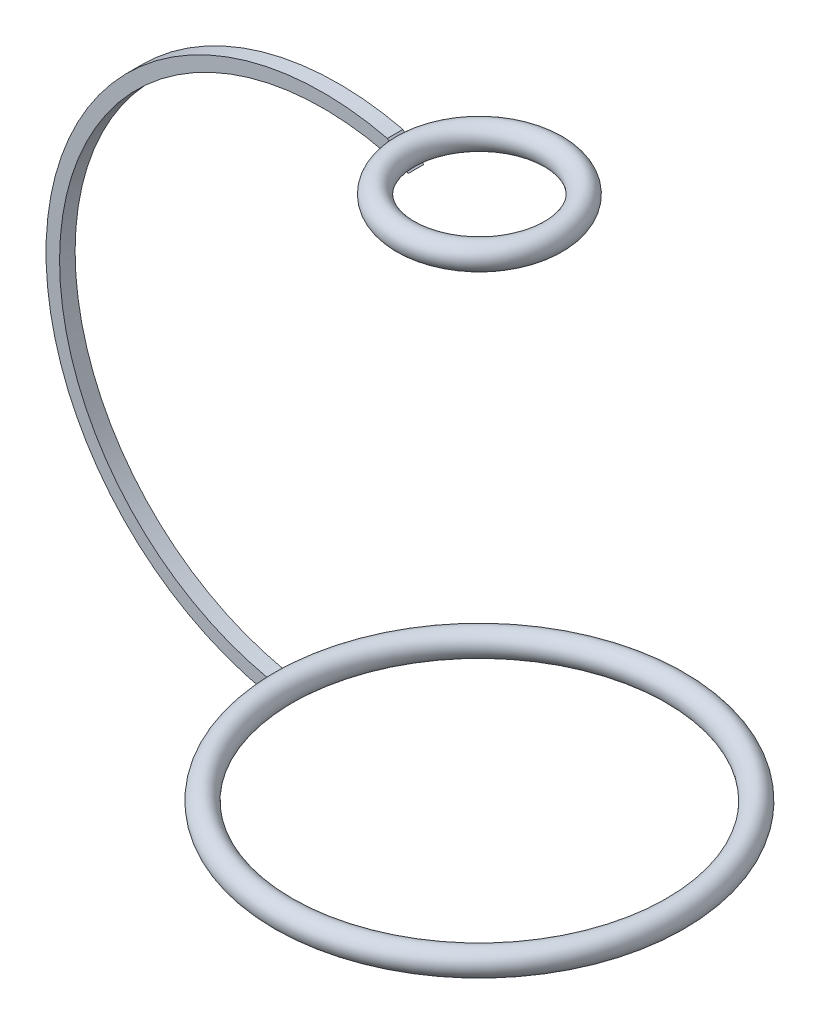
ISO-10303-21;
HEADER;
FILE_DESCRIPTION(('STEP AP214'),'2;1');
FILE_NAME('part.step','',(''),(''),'','','');
FILE_SCHEMA(('AUTOMOTIVE_DESIGN { 1 0 10303 214 1 1 1 1 }'));
ENDSEC;
DATA;
#1=APPLICATION_CONTEXT('core data for automotive mechanical design processes');
#2=APPLICATION_PROTOCOL_DEFINITION('international standard','automotive_design',2000,#1);
#3=PRODUCT_CONTEXT('',#1,'mechanical');
#4=PRODUCT('Part','Part','',(#3));
#5=PRODUCT_RELATED_PRODUCT_CATEGORY('part','',(#4));
#6=PRODUCT_DEFINITION_FORMATION('','',#4);
#7=PRODUCT_DEFINITION_CONTEXT('part definition',#1,'design');
#8=PRODUCT_DEFINITION('design','',#6,#7);
#9=PRODUCT_DEFINITION_SHAPE('','',#8);
#10=(LENGTH_UNIT() NAMED_UNIT(*) SI_UNIT(.MILLI.,.METRE.));
#11=(NAMED_UNIT(*) PLANE_ANGLE_UNIT() SI_UNIT($,.RADIAN.));
#12=(NAMED_UNIT(*) SI_UNIT($,.STERADIAN.) SOLID_ANGLE_UNIT());
#13=UNCERTAINTY_MEASURE_WITH_UNIT(LENGTH_MEASURE(1.E-05),#10,'distance_accuracy_value','');
#14=(GEOMETRIC_REPRESENTATION_CONTEXT(3) GLOBAL_UNCERTAINTY_ASSIGNED_CONTEXT((#13)) GLOBAL_UNIT_ASSIGNED_CONTEXT((#10,
#11,#12)) REPRESENTATION_CONTEXT('',''));
#15=CARTESIAN_POINT('',(0.,0.,0.));
#16=DIRECTION('',(0.,0.,1.));
#17=DIRECTION('',(1.,0.,0.));
#18=AXIS2_PLACEMENT_3D('',#15,#16,#17);
#19=CARTESIAN_POINT('',(-11.8631552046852,-32.6884544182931,0.500000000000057));
#20=DIRECTION('',(-0.389431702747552,0.921055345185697,0.));
#21=DIRECTION('',(-0.921055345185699,-0.389431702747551,0.));
#22=AXIS2_PLACEMENT_3D('',#19,#20,#21);
#23=PLANE('',#22);
#24=DIRECTION('',(0.921055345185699,0.389431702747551,0.));
#25=VECTOR('',#24,1.);
#26=CARTESIAN_POINT('',(-11.8631552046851,-32.6884544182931,-0.500000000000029));
#27=LINE('',#26,#25);
#28=CARTESIAN_POINT('',(-13.3368442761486,-33.311545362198,-0.500000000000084));
#29=VERTEX_POINT('',#28);
#30=CARTESIAN_POINT('',(-13.3288835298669,-33.3081794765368,-0.500000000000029));
#31=VERTEX_POINT('',#30);
#32=EDGE_CURVE('E123',#29,#31,#27,.T.);
#33=ORIENTED_EDGE('',*,*,#32,.T.);
#34=CARTESIAN_POINT('',(-13.3288771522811,-33.3081767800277,-0.500199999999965));
#35=CARTESIAN_POINT('',(-13.3341885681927,-33.3104225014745,-0.333466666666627));
#36=CARTESIAN_POINT('',(-13.3368442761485,-33.311545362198,-0.166733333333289));
#37=CARTESIAN_POINT('',(-13.3368442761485,-33.311545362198,0.166733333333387));
#38=CARTESIAN_POINT('',(-13.3341885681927,-33.3104225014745,0.333466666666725));
#39=CARTESIAN_POINT('',(-13.3288771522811,-33.3081767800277,0.500200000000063));
#40=B_SPLINE_CURVE_WITH_KNOTS('',3,(#34,#35,#36,#37,#38,#39),.UNSPECIFIED.,.F.,.F.,(4,2,4),(0.,
0.50027478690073,1.00054957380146),.UNSPECIFIED.);
#41=CARTESIAN_POINT('',(-13.3368442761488,-33.311545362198,0.));
#42=VERTEX_POINT('',#41);
#43=EDGE_CURVE('E11',#31,#42,#40,.T.);
#44=ORIENTED_EDGE('',*,*,#43,.T.);
#45=DIRECTION('',(0.,0.,-1.));
#46=VECTOR('',#45,1.);
#47=CARTESIAN_POINT('',(-13.3368442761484,-33.311545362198,0.499999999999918));
#48=LINE('',#47,#46);
#49=EDGE_CURVE('E120',#42,#29,#48,.T.);
#50=ORIENTED_EDGE('',*,*,#49,.T.);
#51=EDGE_LOOP('',(#33,#44,#50));
#52=FACE_BOUND('',#51,.T.);
#53=ADVANCED_FACE('F30',(#52),#23,.F.);
#54=CARTESIAN_POINT('',(-9.55723825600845,-15.891797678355,0.500000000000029));
#55=DIRECTION('',(0.,0.,-1.));
#56=DIRECTION('',(-1.,0.,0.));
#57=AXIS2_PLACEMENT_3D('',#54,#55,#56);
#58=CYLINDRICAL_SURFACE('',#57,16.9542011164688);
#59=CARTESIAN_POINT('',(-9.55723825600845,-15.891797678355,0.500000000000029));
#60=DIRECTION('',(0.,0.,-1.));
#61=DIRECTION('',(1.,0.,0.));
#62=AXIS2_PLACEMENT_3D('',#59,#60,#61);
#63=CIRCLE('',#62,16.9542011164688);
#64=CARTESIAN_POINT('',(-13.1763601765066,-32.4552179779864,0.499999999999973));
#65=VERTEX_POINT('',#64);
#66=CARTESIAN_POINT('',(-5.49292410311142,0.568040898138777,0.499999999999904));
#67=VERTEX_POINT('',#66);
#68=EDGE_CURVE('E231',#65,#67,#63,.T.);
#69=ORIENTED_EDGE('',*,*,#68,.F.);
#70=CARTESIAN_POINT('',(-13.1763538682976,-32.4552193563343,0.500199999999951));
#71=CARTESIAN_POINT('',(-13.1816089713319,-32.4540698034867,0.333466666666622));
#72=CARTESIAN_POINT('',(-13.184236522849,-32.4534950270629,0.166733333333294));
#73=CARTESIAN_POINT('',(-13.184236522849,-32.4534950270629,-0.166733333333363));
#74=CARTESIAN_POINT('',(-13.1816089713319,-32.4540698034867,-0.333466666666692));
#75=CARTESIAN_POINT('',(-13.1763538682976,-32.4552193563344,-0.500200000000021));
#76=B_SPLINE_CURVE_WITH_KNOTS('',3,(#70,#71,#72,#73,#74,#75),.UNSPECIFIED.,.F.,.F.,(4,2,4),(0.,
0.500265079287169,1.00053015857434),.UNSPECIFIED.);
#77=CARTESIAN_POINT('',(-13.1763601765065,-32.4552179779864,-0.500000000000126));
#78=VERTEX_POINT('',#77);
#79=EDGE_CURVE('E175',#65,#78,#76,.T.);
#80=ORIENTED_EDGE('',*,*,#79,.T.);
#81=CARTESIAN_POINT('',(-9.55723825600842,-15.891797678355,-0.500000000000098));
#82=DIRECTION('',(0.,0.,-1.));
#83=DIRECTION('',(1.,0.,0.));
#84=AXIS2_PLACEMENT_3D('',#81,#82,#83);
#85=CIRCLE('',#84,16.9542011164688);
#86=CARTESIAN_POINT('',(-5.49292410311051,0.568040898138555,-0.500000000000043));
#87=VERTEX_POINT('',#86);
#88=EDGE_CURVE('E182',#78,#87,#85,.T.);
#89=ORIENTED_EDGE('',*,*,#88,.T.);
#90=CARTESIAN_POINT('',(-5.49290441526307,0.568036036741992,-0.500200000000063));
#91=CARTESIAN_POINT('',(-5.50925855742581,0.57206134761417,-0.333466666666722));
#92=CARTESIAN_POINT('',(-5.51743562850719,0.574074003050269,-0.16673333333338));
#93=CARTESIAN_POINT('',(-5.51743562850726,0.574074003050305,0.166733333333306));
#94=CARTESIAN_POINT('',(-5.50925855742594,0.572061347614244,0.333466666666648));
#95=CARTESIAN_POINT('',(-5.49290441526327,0.568036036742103,0.500199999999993));
#96=B_SPLINE_CURVE_WITH_KNOTS('',3,(#90,#91,#92,#93,#94,#95),.UNSPECIFIED.,.F.,.F.,(4,2,4),(0.,
0.500837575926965,1.00167515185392),.UNSPECIFIED.);
#97=EDGE_CURVE('E194',#87,#67,#96,.T.);
#98=ORIENTED_EDGE('',*,*,#97,.T.);
#99=EDGE_LOOP('',(#69,#80,#89,#98));
#100=FACE_BOUND('',#99,.T.);
#101=ADVANCED_FACE('F188',(#100),#58,.F.);
#102=CARTESIAN_POINT('',(-5.41786459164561,1.44598236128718,0.49999999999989));
#103=DIRECTION('',(-0.695233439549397,-0.718784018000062,0.));
#104=DIRECTION('',(0.718784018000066,-0.695233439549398,0.));
#105=AXIS2_PLACEMENT_3D('',#102,#103,#104);
#106=PLANE('',#105);
#107=DIRECTION('',(-0.718784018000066,0.695233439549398,0.));
#108=VECTOR('',#107,1.);
#109=CARTESIAN_POINT('',(-5.41786459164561,1.44598236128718,0.49999999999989));
#110=LINE('',#109,#108);
#111=CARTESIAN_POINT('',(-5.31277848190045,1.34433934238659,0.499999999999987));
#112=VERTEX_POINT('',#111);
#113=CARTESIAN_POINT('',(-5.41786459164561,1.44598236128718,0.49999999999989));
#114=VERTEX_POINT('',#113);
#115=EDGE_CURVE('E229',#112,#114,#110,.T.);
#116=ORIENTED_EDGE('',*,*,#115,.F.);
#117=CARTESIAN_POINT('',(-5.31276858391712,1.3443297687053,0.500200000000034));
#118=CARTESIAN_POINT('',(-5.31688269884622,1.3483090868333,0.416915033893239));
#119=CARTESIAN_POINT('',(-5.31994852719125,1.35127446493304,0.333532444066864));
#120=CARTESIAN_POINT('',(-5.32401959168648,1.3552121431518,0.166766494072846));
#121=CARTESIAN_POINT('',(-5.32502721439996,1.35618675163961,0.0833832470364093));
#122=CARTESIAN_POINT('',(-5.32502721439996,1.35618675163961,-0.083383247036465));
#123=CARTESIAN_POINT('',(-5.32401959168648,1.3552121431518,-0.166766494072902));
#124=CARTESIAN_POINT('',(-5.31994852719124,1.35127446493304,-0.33353244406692));
#125=CARTESIAN_POINT('',(-5.3168826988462,1.3483090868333,-0.416915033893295));
#126=CARTESIAN_POINT('',(-5.31276858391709,1.3443297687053,-0.50020000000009));
#127=B_SPLINE_CURVE_WITH_KNOTS('',3,(#117,#118,#119,#120,#121,#122,#123,#124,#125,#126),
.UNSPECIFIED.,.F.,.F.,(4,2,2,2,4),(0.,0.250427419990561,0.500564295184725,0.750701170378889,
1.00112859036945),.UNSPECIFIED.);
#128=CARTESIAN_POINT('',(-5.31277848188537,1.34433934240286,-0.500000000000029));
#129=VERTEX_POINT('',#128);
#130=EDGE_CURVE('E149',#112,#129,#127,.T.);
#131=ORIENTED_EDGE('',*,*,#130,.T.);
#132=DIRECTION('',(-0.718784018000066,0.695233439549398,0.));
#133=VECTOR('',#132,1.);
#134=CARTESIAN_POINT('',(-5.41786459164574,1.44598236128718,-0.500000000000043));
#135=LINE('',#134,#133);
#136=CARTESIAN_POINT('',(-5.41786459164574,1.44598236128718,-0.500000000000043));
#137=VERTEX_POINT('',#136);
#138=EDGE_CURVE('E235',#129,#137,#135,.T.);
#139=ORIENTED_EDGE('',*,*,#138,.T.);
#140=DIRECTION('',(0.,0.,-1.));
#141=VECTOR('',#140,1.);
#142=CARTESIAN_POINT('',(-5.41786459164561,1.44598236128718,0.49999999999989));
#143=LINE('',#142,#141);
#144=EDGE_CURVE('E135',#114,#137,#143,.T.);
#145=ORIENTED_EDGE('',*,*,#144,.F.);
#146=EDGE_LOOP('',(#116,#131,#139,#145));
#147=FACE_BOUND('',#146,.T.);
#148=ADVANCED_FACE('F189',(#147),#106,.F.);
#149=CARTESIAN_POINT('',(-9.55723825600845,-15.891797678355,0.500000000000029));
#150=DIRECTION('',(0.,0.,1.));
#151=DIRECTION('',(1.,0.,0.));
#152=AXIS2_PLACEMENT_3D('',#149,#150,#151);
#153=PLANE('',#152);
#154=CARTESIAN_POINT('',(-13.3892009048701,-33.0484168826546,0.500000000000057));
#155=CARTESIAN_POINT('',(-13.3864786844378,-33.0932498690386,0.500000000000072));
#156=CARTESIAN_POINT('',(-13.3799674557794,-33.1378856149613,0.500000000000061));
#157=CARTESIAN_POINT('',(-13.3595361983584,-33.2254669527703,0.499999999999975));
#158=CARTESIAN_POINT('',(-13.3456072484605,-33.2684104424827,0.4999999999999));
#159=CARTESIAN_POINT('',(-13.3107420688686,-33.3513314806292,0.499999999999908));
#160=CARTESIAN_POINT('',(-13.2898093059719,-33.3913104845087,0.49999999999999));
#161=CARTESIAN_POINT('',(-13.2415366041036,-33.4671770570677,0.500000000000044));
#162=CARTESIAN_POINT('',(-13.2141982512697,-33.5030656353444,0.500000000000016));
#163=CARTESIAN_POINT('',(-13.1538751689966,-33.5697634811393,0.500000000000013));
#164=CARTESIAN_POINT('',(-13.1208879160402,-33.6005704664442,0.500000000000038));
#165=CARTESIAN_POINT('',(-13.0502113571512,-33.6562148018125,0.499999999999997));
#166=CARTESIAN_POINT('',(-13.0125218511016,-33.6810518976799,0.49999999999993));
#167=CARTESIAN_POINT('',(-12.9334847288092,-33.7240678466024,0.499999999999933));
#168=CARTESIAN_POINT('',(-12.8921346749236,-33.7422422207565,0.500000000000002));
#169=CARTESIAN_POINT('',(-12.8069716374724,-33.7713960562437,0.500000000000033));
#170=CARTESIAN_POINT('',(-12.763158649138,-33.7823755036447,0.499999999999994));
#171=CARTESIAN_POINT('',(-12.6742824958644,-33.796834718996,0.499999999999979));
#172=CARTESIAN_POINT('',(-12.6292185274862,-33.8003095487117,0.500000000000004));
#173=CARTESIAN_POINT('',(-12.5391466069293,-33.7996471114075,0.500000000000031));
#174=CARTESIAN_POINT('',(-12.4941386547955,-33.795509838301,0.500000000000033));
#175=CARTESIAN_POINT('',(-12.405440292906,-33.7797376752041,0.500000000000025));
#176=CARTESIAN_POINT('',(-12.3617503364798,-33.7681002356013,0.500000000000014));
#177=CARTESIAN_POINT('',(-12.2769446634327,-33.7376544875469,0.500000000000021));
#178=CARTESIAN_POINT('',(-12.2358289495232,-33.7188461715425,0.500000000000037));
#179=CARTESIAN_POINT('',(-12.1573468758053,-33.6745944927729,0.500000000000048));
#180=CARTESIAN_POINT('',(-12.1199799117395,-33.6491522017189,0.500000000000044));
#181=CARTESIAN_POINT('',(-12.0500512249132,-33.5923516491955,0.499999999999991));
#182=CARTESIAN_POINT('',(-12.0174894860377,-33.560993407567,0.499999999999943));
#183=CARTESIAN_POINT('',(-11.958118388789,-33.493271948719,0.499999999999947));
#184=CARTESIAN_POINT('',(-11.9313053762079,-33.4569119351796,0.5));
#185=CARTESIAN_POINT('',(-11.8841703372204,-33.3802033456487,0.500000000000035));
#186=CARTESIAN_POINT('',(-11.8638482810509,-33.3398547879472,0.500000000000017));
#187=CARTESIAN_POINT('',(-11.8302899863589,-33.2563510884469,0.500000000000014));
#188=CARTESIAN_POINT('',(-11.8170477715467,-33.2131983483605,0.500000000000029));
#189=CARTESIAN_POINT('',(-11.7980012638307,-33.1252815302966,0.500000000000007));
#190=CARTESIAN_POINT('',(-11.7921969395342,-33.0805174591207,0.499999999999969));
#191=CARTESIAN_POINT('',(-11.78819337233,-32.9906794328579,0.499999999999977));
#192=CARTESIAN_POINT('',(-11.7899892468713,-32.9456056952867,0.500000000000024));
#193=CARTESIAN_POINT('',(-11.801123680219,-32.8563997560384,0.500000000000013));
#194=CARTESIAN_POINT('',(-11.8104622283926,-32.8122675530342,0.499999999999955));
#195=CARTESIAN_POINT('',(-11.8364140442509,-32.7262018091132,0.499999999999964));
#196=CARTESIAN_POINT('',(-11.8530265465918,-32.6842680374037,0.50000000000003));
#197=CARTESIAN_POINT('',(-11.8930525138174,-32.6037827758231,0.500000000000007));
#198=CARTESIAN_POINT('',(-11.9164659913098,-32.5652312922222,0.499999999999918));
#199=CARTESIAN_POINT('',(-11.9694404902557,-32.4925841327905,0.499999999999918));
#200=CARTESIAN_POINT('',(-11.9990045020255,-32.4584906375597,0.500000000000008));
#201=CARTESIAN_POINT('',(-12.0634324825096,-32.3957458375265,0.500000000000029));
#202=CARTESIAN_POINT('',(-12.0982964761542,-32.367094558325,0.499999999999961));
#203=CARTESIAN_POINT('',(-12.1723654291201,-32.3160223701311,0.499999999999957));
#204=CARTESIAN_POINT('',(-12.2115739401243,-32.2936066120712,0.500000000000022));
#205=CARTESIAN_POINT('',(-12.2931956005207,-32.2556701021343,0.500000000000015));
#206=CARTESIAN_POINT('',(-12.3356087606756,-32.2401493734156,0.499999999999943));
#207=CARTESIAN_POINT('',(-12.4224699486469,-32.21643222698,0.499999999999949));
#208=CARTESIAN_POINT('',(-12.4669194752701,-32.2082412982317,0.500000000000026));
#209=CARTESIAN_POINT('',(-12.5565628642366,-32.1994352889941,0.50000000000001));
#210=CARTESIAN_POINT('',(-12.6017567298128,-32.1988202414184,0.499999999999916));
#211=CARTESIAN_POINT('',(-12.6916219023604,-32.2051849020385,0.499999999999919));
#212=CARTESIAN_POINT('',(-12.7362930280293,-32.2121671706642,0.500000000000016));
#213=CARTESIAN_POINT('',(-12.8238287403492,-32.2335335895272,0.500000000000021));
#214=CARTESIAN_POINT('',(-12.8666933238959,-32.247917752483,0.49999999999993));
#215=CARTESIAN_POINT('',(-12.9493909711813,-32.2836783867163,0.499999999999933));
#216=CARTESIAN_POINT('',(-12.9892245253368,-32.3050537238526,0.500000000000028));
#217=CARTESIAN_POINT('',(-13.0647332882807,-32.3541914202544,0.500000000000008));
#218=CARTESIAN_POINT('',(-13.1004086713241,-32.3819535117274,0.499999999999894));
#219=CARTESIAN_POINT('',(-13.166564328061,-32.443056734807,0.499999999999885));
#220=CARTESIAN_POINT('',(-13.1970481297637,-32.4763940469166,0.49999999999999));
#221=CARTESIAN_POINT('',(-13.2519890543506,-32.5477260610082,0.500000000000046));
#222=CARTESIAN_POINT('',(-13.2764446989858,-32.5857219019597,0.499999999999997));
#223=CARTESIAN_POINT('',(-13.3186166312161,-32.6652697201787,0.499999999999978));
#224=CARTESIAN_POINT('',(-13.3363344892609,-32.7068208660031,0.500000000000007));
#225=CARTESIAN_POINT('',(-13.3645170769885,-32.7922759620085,0.500000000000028));
#226=CARTESIAN_POINT('',(-13.3749905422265,-32.8361770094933,0.50000000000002));
#227=CARTESIAN_POINT('',(-13.3858945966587,-32.908353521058,0.500000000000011));
#228=CARTESIAN_POINT('',(-13.3886199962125,-32.9363025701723,0.500000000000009));
#229=CARTESIAN_POINT('',(-13.3911233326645,-32.9923323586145,0.500000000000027));
#230=CARTESIAN_POINT('',(-13.3909012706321,-33.0204130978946,0.500000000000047));
#231=CARTESIAN_POINT('',(-13.3892009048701,-33.0484168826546,0.500000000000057));
#232=B_SPLINE_CURVE_WITH_KNOTS('',3,(#154,#155,#156,#157,#158,#159,#160,#161,#162,#163,#164,
#165,#166,#167,#168,#169,#170,#171,#172,#173,#174,#175,#176,#177,#178,#179,#180,#181,#182,#183,
#184,#185,#186,#187,#188,#189,#190,#191,#192,#193,#194,#195,#196,#197,#198,#199,#200,#201,#202,
#203,#204,#205,#206,#207,#208,#209,#210,#211,#212,#213,#214,#215,#216,#217,#218,#219,#220,#221,
#222,#223,#224,#225,#226,#227,#228,#229,#230,#231),.UNSPECIFIED.,.T.,.F.,(4,2,2,2,2,2,2,2,2,2,2,
2,2,2,2,2,2,2,2,2,2,2,2,2,2,2,2,2,2,2,2,2,2,2,2,2,2,2,4),(0.,0.134644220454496,
0.269450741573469,0.40419063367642,0.538897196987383,0.673664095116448,0.808436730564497,
0.943299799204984,1.07816312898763,1.21311517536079,1.34806732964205,1.4830653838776,
1.61806358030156,1.75303998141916,1.88801592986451,2.02290582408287,2.15779509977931,
2.29257033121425,2.42734499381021,2.5620330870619,2.69672099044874,2.83139472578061,
2.96606871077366,3.1008083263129,3.23554857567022,3.37039980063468,3.50525147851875,
3.64020405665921,3.77515722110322,3.91015588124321,4.04515477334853,4.18013177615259,
4.31510312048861,4.4499823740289,4.58489467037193,4.71977550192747,4.85449340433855,
4.93859552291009,5.02269761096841),.UNSPECIFIED.);
#233=CARTESIAN_POINT('',(-13.3288835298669,-33.3081794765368,0.500000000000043));
#234=VERTEX_POINT('',#233);
#235=EDGE_CURVE('E51',#65,#234,#232,.T.);
#236=ORIENTED_EDGE('',*,*,#235,.F.);
#237=ORIENTED_EDGE('',*,*,#68,.T.);
#238=CARTESIAN_POINT('',(-5.31026768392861,0.252980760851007,0.499999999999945));
#239=CARTESIAN_POINT('',(-5.27931823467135,0.220101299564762,0.499999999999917));
#240=CARTESIAN_POINT('',(-5.24555903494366,0.189820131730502,0.500000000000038));
#241=CARTESIAN_POINT('',(-5.17340169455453,0.135338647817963,0.50000000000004));
#242=CARTESIAN_POINT('',(-5.13499777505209,0.111146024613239,0.499999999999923));
#243=CARTESIAN_POINT('',(-5.05469955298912,0.0695591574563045,0.499999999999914));
#244=CARTESIAN_POINT('',(-5.0128076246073,0.0521603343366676,0.500000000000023));
#245=CARTESIAN_POINT('',(-4.92671583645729,0.0246217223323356,0.500000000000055));
#246=CARTESIAN_POINT('',(-4.88251655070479,0.0144801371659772,0.499999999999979));
#247=CARTESIAN_POINT('',(-4.79289207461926,0.00169718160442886,0.499999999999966));
#248=CARTESIAN_POINT('',(-4.74746321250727,-0.000918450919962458,0.50000000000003));
#249=CARTESIAN_POINT('',(-4.65680619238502,0.00148866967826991,0.500000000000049));
#250=CARTESIAN_POINT('',(-4.61157804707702,0.00651189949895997,0.500000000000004));
#251=CARTESIAN_POINT('',(-4.52246175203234,0.024080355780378,0.499999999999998));
#252=CARTESIAN_POINT('',(-4.4785781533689,0.0366486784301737,0.500000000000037));
#253=CARTESIAN_POINT('',(-4.39354364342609,0.0689754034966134,0.500000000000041));
#254=CARTESIAN_POINT('',(-4.35239274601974,0.0887338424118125,0.500000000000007));
#255=CARTESIAN_POINT('',(-4.27400898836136,0.13488639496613,0.500000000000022));
#256=CARTESIAN_POINT('',(-4.23677523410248,0.161278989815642,0.500000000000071));
#257=CARTESIAN_POINT('',(-4.16729185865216,0.219966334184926,0.500000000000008));
#258=CARTESIAN_POINT('',(-4.13504213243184,0.252260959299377,0.499999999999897));
#259=CARTESIAN_POINT('',(-4.07660417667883,0.321688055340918,0.499999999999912));
#260=CARTESIAN_POINT('',(-4.05038954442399,0.358798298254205,0.500000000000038));
#261=CARTESIAN_POINT('',(-4.00461551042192,0.436918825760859,0.500000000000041));
#262=CARTESIAN_POINT('',(-3.98505583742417,0.477928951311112,0.49999999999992));
#263=CARTESIAN_POINT('',(-3.95329567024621,0.56236950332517,0.499999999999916));
#264=CARTESIAN_POINT('',(-3.9410433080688,0.605780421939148,0.500000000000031));
#265=CARTESIAN_POINT('',(-3.92404893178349,0.694047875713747,0.500000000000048));
#266=CARTESIAN_POINT('',(-3.91930661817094,0.738904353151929,0.499999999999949));
#267=CARTESIAN_POINT('',(-3.91748121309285,0.828508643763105,0.499999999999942));
#268=CARTESIAN_POINT('',(-3.92035337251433,0.873255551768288,0.500000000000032));
#269=CARTESIAN_POINT('',(-3.93357506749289,0.961629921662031,0.500000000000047));
#270=CARTESIAN_POINT('',(-3.94392452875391,1.00525739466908,0.499999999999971));
#271=CARTESIAN_POINT('',(-3.97178267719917,1.09013253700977,0.499999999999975));
#272=CARTESIAN_POINT('',(-3.98928700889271,1.13138163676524,0.500000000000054));
#273=CARTESIAN_POINT('',(-4.03093864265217,1.21037639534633,0.500000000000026));
#274=CARTESIAN_POINT('',(-4.05508609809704,1.24812197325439,0.499999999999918));
#275=CARTESIAN_POINT('',(-4.10946156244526,1.31924709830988,0.499999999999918));
#276=CARTESIAN_POINT('',(-4.13971961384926,1.3526036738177,0.500000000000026));
#277=CARTESIAN_POINT('',(-4.20537012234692,1.41380906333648,0.500000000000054));
#278=CARTESIAN_POINT('',(-4.24076277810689,1.44165766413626,0.499999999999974));
#279=CARTESIAN_POINT('',(-4.31595455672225,1.4912682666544,0.499999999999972));
#280=CARTESIAN_POINT('',(-4.35578379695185,1.51298462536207,0.50000000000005));
#281=CARTESIAN_POINT('',(-4.43850891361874,1.549463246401,0.50000000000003));
#282=CARTESIAN_POINT('',(-4.48140488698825,1.56422528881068,0.499999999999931));
#283=CARTESIAN_POINT('',(-4.56929006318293,1.58644686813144,0.499999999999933));
#284=CARTESIAN_POINT('',(-4.61428911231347,1.59386748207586,0.500000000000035));
#285=CARTESIAN_POINT('',(-4.7048948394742,1.60105898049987,0.500000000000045));
#286=CARTESIAN_POINT('',(-4.75050152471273,1.60082977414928,0.499999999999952));
#287=CARTESIAN_POINT('',(-4.84108381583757,1.59271553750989,0.499999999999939));
#288=CARTESIAN_POINT('',(-4.88605861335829,1.5848214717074,0.500000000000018));
#289=CARTESIAN_POINT('',(-4.97403830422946,1.56157585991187,0.500000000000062));
#290=CARTESIAN_POINT('',(-5.01704321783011,1.54622439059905,0.500000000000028));
#291=CARTESIAN_POINT('',(-5.09974484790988,1.50853440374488,0.500000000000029));
#292=CARTESIAN_POINT('',(-5.13944953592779,1.48621338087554,0.500000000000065));
#293=CARTESIAN_POINT('',(-5.21452589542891,1.43519428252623,0.500000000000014));
#294=CARTESIAN_POINT('',(-5.24989765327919,1.40649633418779,0.499999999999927));
#295=CARTESIAN_POINT('',(-5.31513741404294,1.34367227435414,0.499999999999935));
#296=CARTESIAN_POINT('',(-5.3450289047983,1.30957055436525,0.50000000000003));
#297=CARTESIAN_POINT('',(-5.39863192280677,1.23681371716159,0.50000000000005));
#298=CARTESIAN_POINT('',(-5.42234358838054,1.1981587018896,0.499999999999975));
#299=CARTESIAN_POINT('',(-5.46280586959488,1.11757588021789,0.499999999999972));
#300=CARTESIAN_POINT('',(-5.47958661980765,1.07566320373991,0.500000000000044));
#301=CARTESIAN_POINT('',(-5.50584814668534,0.989611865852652,0.500000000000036));
#302=CARTESIAN_POINT('',(-5.51532935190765,0.94547333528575,0.499999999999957));
#303=CARTESIAN_POINT('',(-5.52669880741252,0.856371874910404,0.499999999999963));
#304=CARTESIAN_POINT('',(-5.52861103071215,0.811412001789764,0.500000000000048));
#305=CARTESIAN_POINT('',(-5.52485182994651,0.721798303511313,0.500000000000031));
#306=CARTESIAN_POINT('',(-5.51917857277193,0.6771445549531,0.49999999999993));
#307=CARTESIAN_POINT('',(-5.50041799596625,0.589449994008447,0.499999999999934));
#308=CARTESIAN_POINT('',(-5.48733422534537,0.54640842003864,0.50000000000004));
#309=CARTESIAN_POINT('',(-5.45414064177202,0.46316759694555,0.500000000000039));
#310=CARTESIAN_POINT('',(-5.43403934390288,0.422964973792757,0.499999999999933));
#311=CARTESIAN_POINT('',(-5.39632891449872,0.361124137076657,0.499999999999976));
#312=CARTESIAN_POINT('',(-5.38069643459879,0.338256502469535,0.500000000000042));
#313=CARTESIAN_POINT('',(-5.34715036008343,0.294260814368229,0.500000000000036));
#314=CARTESIAN_POINT('',(-5.32923676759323,0.273132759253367,0.499999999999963));
#315=CARTESIAN_POINT('',(-5.31026768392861,0.252980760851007,0.499999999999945));
#316=B_SPLINE_CURVE_WITH_KNOTS('',3,(#238,#239,#240,#241,#242,#243,#244,#245,#246,#247,#248,
#249,#250,#251,#252,#253,#254,#255,#256,#257,#258,#259,#260,#261,#262,#263,#264,#265,#266,#267,
#268,#269,#270,#271,#272,#273,#274,#275,#276,#277,#278,#279,#280,#281,#282,#283,#284,#285,#286,
#287,#288,#289,#290,#291,#292,#293,#294,#295,#296,#297,#298,#299,#300,#301,#302,#303,#304,#305,
#306,#307,#308,#309,#310,#311,#312,#313,#314,#315),.UNSPECIFIED.,.T.,.F.,(4,2,2,2,2,2,2,2,2,2,2,
2,2,2,2,2,2,2,2,2,2,2,2,2,2,2,2,2,2,2,2,2,2,2,2,2,2,2,4),(0.,0.135361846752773,
0.270893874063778,0.406334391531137,0.541741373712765,0.677610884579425,0.813488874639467,
0.949784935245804,1.0860816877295,1.22234726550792,1.35860997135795,1.4942647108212,
1.62991392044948,1.76458845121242,1.89925761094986,2.03313709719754,2.1670152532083,
2.30081203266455,2.43461190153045,2.5690863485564,2.70356600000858,2.83902169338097,
2.97448167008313,3.11065604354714,3.246832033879,3.38316874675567,3.51950405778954,
3.65549986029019,3.79149295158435,3.92688882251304,4.06228166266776,4.19707947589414,
4.33186937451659,4.46623201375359,4.60062712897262,4.7349579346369,4.86912630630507,
4.95209038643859,5.03505438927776),.UNSPECIFIED.);
#317=EDGE_CURVE('E208',#112,#67,#316,.T.);
#318=ORIENTED_EDGE('',*,*,#317,.F.);
#319=ORIENTED_EDGE('',*,*,#115,.T.);
#320=CARTESIAN_POINT('',(-9.55723825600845,-15.891797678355,0.500000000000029));
#321=DIRECTION('',(0.,0.,1.));
#322=DIRECTION('',(1.,0.,0.));
#323=AXIS2_PLACEMENT_3D('',#320,#321,#322);
#324=CIRCLE('',#323,17.8250674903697);
#325=CARTESIAN_POINT('',(-13.3368442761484,-33.311545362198,0.499999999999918));
#326=VERTEX_POINT('',#325);
#327=EDGE_CURVE('E228',#114,#326,#324,.T.);
#328=ORIENTED_EDGE('',*,*,#327,.T.);
#329=DIRECTION('',(0.921055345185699,0.389431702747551,0.));
#330=VECTOR('',#329,1.);
#331=CARTESIAN_POINT('',(-11.8631552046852,-32.6884544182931,0.500000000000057));
#332=LINE('',#331,#330);
#333=EDGE_CURVE('E132',#326,#234,#332,.T.);
#334=ORIENTED_EDGE('',*,*,#333,.T.);
#335=EDGE_LOOP('',(#236,#237,#318,#319,#328,#334));
#336=FACE_BOUND('',#335,.T.);
#337=ADVANCED_FACE('F246',(#336),#153,.T.);
#338=CARTESIAN_POINT('',(-9.55723825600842,-15.891797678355,-0.500000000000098));
#339=DIRECTION('',(0.,0.,1.));
#340=DIRECTION('',(1.,0.,0.));
#341=AXIS2_PLACEMENT_3D('',#338,#339,#340);
#342=PLANE('',#341);
#343=ORIENTED_EDGE('',*,*,#88,.F.);
#344=CARTESIAN_POINT('',(-13.3892009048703,-33.0484168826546,-0.500000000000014));
#345=CARTESIAN_POINT('',(-13.386478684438,-33.0932498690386,-0.499999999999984));
#346=CARTESIAN_POINT('',(-13.3799674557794,-33.1378856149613,-0.500000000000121));
#347=CARTESIAN_POINT('',(-13.3595361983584,-33.2254669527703,-0.500000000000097));
#348=CARTESIAN_POINT('',(-13.3456072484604,-33.2684104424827,-0.499999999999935));
#349=CARTESIAN_POINT('',(-13.3107420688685,-33.3513314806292,-0.499999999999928));
#350=CARTESIAN_POINT('',(-13.2898093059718,-33.3913104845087,-0.500000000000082));
#351=CARTESIAN_POINT('',(-13.2415366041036,-33.4671770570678,-0.500000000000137));
#352=CARTESIAN_POINT('',(-13.2141982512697,-33.5030656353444,-0.500000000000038));
#353=CARTESIAN_POINT('',(-13.1538751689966,-33.5697634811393,-0.500000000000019));
#354=CARTESIAN_POINT('',(-13.1208879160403,-33.6005704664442,-0.5000000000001));
#355=CARTESIAN_POINT('',(-13.0502113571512,-33.6562148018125,-0.500000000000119));
#356=CARTESIAN_POINT('',(-13.0125218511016,-33.6810518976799,-0.500000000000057));
#357=CARTESIAN_POINT('',(-12.9334847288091,-33.7240678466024,-0.500000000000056));
#358=CARTESIAN_POINT('',(-12.8921346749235,-33.7422422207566,-0.500000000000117));
#359=CARTESIAN_POINT('',(-12.8069716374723,-33.7713960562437,-0.500000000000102));
#360=CARTESIAN_POINT('',(-12.7631586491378,-33.7823755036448,-0.500000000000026));
#361=CARTESIAN_POINT('',(-12.6742824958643,-33.796834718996,-0.500000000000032));
#362=CARTESIAN_POINT('',(-12.629218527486,-33.8003095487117,-0.500000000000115));
#363=CARTESIAN_POINT('',(-12.5391466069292,-33.7996471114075,-0.500000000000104));
#364=CARTESIAN_POINT('',(-12.4941386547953,-33.795509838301,-0.500000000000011));
#365=CARTESIAN_POINT('',(-12.4054402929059,-33.7797376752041,-0.500000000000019));
#366=CARTESIAN_POINT('',(-12.3617503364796,-33.7681002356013,-0.50000000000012));
#367=CARTESIAN_POINT('',(-12.2769446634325,-33.7376544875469,-0.500000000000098));
#368=CARTESIAN_POINT('',(-12.235828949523,-33.7188461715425,-0.499999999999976));
#369=CARTESIAN_POINT('',(-12.1573468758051,-33.674594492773,-0.499999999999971));
#370=CARTESIAN_POINT('',(-12.1199799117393,-33.6491522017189,-0.500000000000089));
#371=CARTESIAN_POINT('',(-12.0500512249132,-33.5923516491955,-0.500000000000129));
#372=CARTESIAN_POINT('',(-12.0174894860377,-33.5609934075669,-0.500000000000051));
#373=CARTESIAN_POINT('',(-11.9581183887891,-33.493271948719,-0.500000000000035));
#374=CARTESIAN_POINT('',(-11.9313053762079,-33.4569119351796,-0.500000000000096));
#375=CARTESIAN_POINT('',(-11.8841703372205,-33.3802033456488,-0.500000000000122));
#376=CARTESIAN_POINT('',(-11.8638482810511,-33.3398547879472,-0.500000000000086));
#377=CARTESIAN_POINT('',(-11.830289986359,-33.2563510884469,-0.500000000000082));
#378=CARTESIAN_POINT('',(-11.8170477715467,-33.2131983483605,-0.500000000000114));
#379=CARTESIAN_POINT('',(-11.7980012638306,-33.1252815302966,-0.500000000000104));
#380=CARTESIAN_POINT('',(-11.7921969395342,-33.0805174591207,-0.500000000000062));
#381=CARTESIAN_POINT('',(-11.78819337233,-32.9906794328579,-0.50000000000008));
#382=CARTESIAN_POINT('',(-11.7899892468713,-32.9456056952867,-0.500000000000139));
#383=CARTESIAN_POINT('',(-11.801123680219,-32.8563997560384,-0.500000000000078));
#384=CARTESIAN_POINT('',(-11.8104622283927,-32.8122675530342,-0.499999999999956));
#385=CARTESIAN_POINT('',(-11.836414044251,-32.7262018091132,-0.499999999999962));
#386=CARTESIAN_POINT('',(-11.8530265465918,-32.6842680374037,-0.50000000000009));
#387=CARTESIAN_POINT('',(-11.8930525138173,-32.603782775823,-0.500000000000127));
#388=CARTESIAN_POINT('',(-11.9164659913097,-32.5652312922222,-0.500000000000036));
#389=CARTESIAN_POINT('',(-11.9694404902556,-32.4925841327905,-0.50000000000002));
#390=CARTESIAN_POINT('',(-11.9990045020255,-32.4584906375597,-0.500000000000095));
#391=CARTESIAN_POINT('',(-12.0634324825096,-32.3957458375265,-0.500000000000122));
#392=CARTESIAN_POINT('',(-12.0982964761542,-32.367094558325,-0.500000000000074));
#393=CARTESIAN_POINT('',(-12.1723654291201,-32.3160223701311,-0.500000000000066));
#394=CARTESIAN_POINT('',(-12.2115739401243,-32.2936066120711,-0.500000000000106));
#395=CARTESIAN_POINT('',(-12.2931956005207,-32.2556701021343,-0.500000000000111));
#396=CARTESIAN_POINT('',(-12.3356087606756,-32.2401493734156,-0.500000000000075));
#397=CARTESIAN_POINT('',(-12.4224699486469,-32.21643222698,-0.500000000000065));
#398=CARTESIAN_POINT('',(-12.4669194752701,-32.2082412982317,-0.50000000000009));
#399=CARTESIAN_POINT('',(-12.5565628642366,-32.1994352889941,-0.500000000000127));
#400=CARTESIAN_POINT('',(-12.6017567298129,-32.1988202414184,-0.500000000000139));
#401=CARTESIAN_POINT('',(-12.6916219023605,-32.2051849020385,-0.50000000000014));
#402=CARTESIAN_POINT('',(-12.7362930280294,-32.2121671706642,-0.50000000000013));
#403=CARTESIAN_POINT('',(-12.8238287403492,-32.2335335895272,-0.500000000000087));
#404=CARTESIAN_POINT('',(-12.8666933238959,-32.247917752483,-0.500000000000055));
#405=CARTESIAN_POINT('',(-12.9493909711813,-32.2836783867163,-0.500000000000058));
#406=CARTESIAN_POINT('',(-12.9892245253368,-32.3050537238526,-0.500000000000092));
#407=CARTESIAN_POINT('',(-13.0647332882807,-32.3541914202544,-0.500000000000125));
#408=CARTESIAN_POINT('',(-13.1004086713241,-32.3819535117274,-0.500000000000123));
#409=CARTESIAN_POINT('',(-13.1665643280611,-32.443056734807,-0.500000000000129));
#410=CARTESIAN_POINT('',(-13.1970481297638,-32.4763940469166,-0.500000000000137));
#411=CARTESIAN_POINT('',(-13.2519890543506,-32.5477260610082,-0.50000000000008));
#412=CARTESIAN_POINT('',(-13.2764446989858,-32.5857219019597,-0.500000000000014));
#413=CARTESIAN_POINT('',(-13.3186166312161,-32.6652697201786,-0.500000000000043));
#414=CARTESIAN_POINT('',(-13.336334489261,-32.706820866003,-0.500000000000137));
#415=CARTESIAN_POINT('',(-13.3645170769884,-32.7922759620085,-0.500000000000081));
#416=CARTESIAN_POINT('',(-13.3749905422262,-32.8361770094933,-0.499999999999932));
#417=CARTESIAN_POINT('',(-13.3858945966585,-32.908353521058,-0.5));
#418=CARTESIAN_POINT('',(-13.3886199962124,-32.9363025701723,-0.500000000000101));
#419=CARTESIAN_POINT('',(-13.3911233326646,-32.9923323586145,-0.500000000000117));
#420=CARTESIAN_POINT('',(-13.3909012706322,-33.0204130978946,-0.500000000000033));
#421=CARTESIAN_POINT('',(-13.3892009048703,-33.0484168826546,-0.500000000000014));
#422=B_SPLINE_CURVE_WITH_KNOTS('',3,(#344,#345,#346,#347,#348,#349,#350,#351,#352,#353,#354,
#355,#356,#357,#358,#359,#360,#361,#362,#363,#364,#365,#366,#367,#368,#369,#370,#371,#372,#373,
#374,#375,#376,#377,#378,#379,#380,#381,#382,#383,#384,#385,#386,#387,#388,#389,#390,#391,#392,
#393,#394,#395,#396,#397,#398,#399,#400,#401,#402,#403,#404,#405,#406,#407,#408,#409,#410,#411,
#412,#413,#414,#415,#416,#417,#418,#419,#420,#421),.UNSPECIFIED.,.T.,.F.,(4,2,2,2,2,2,2,2,2,2,2,
2,2,2,2,2,2,2,2,2,2,2,2,2,2,2,2,2,2,2,2,2,2,2,2,2,2,2,4),(0.,0.134644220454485,
0.269450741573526,0.40419063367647,0.538897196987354,0.673664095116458,0.80843673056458,
0.943299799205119,1.0781631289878,1.21311517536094,1.34806732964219,1.4830653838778,
1.61806358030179,1.75303998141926,1.88801592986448,2.02290582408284,2.15779509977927,
2.29257033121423,2.42734499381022,2.5620330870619,2.69672099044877,2.83139472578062,
2.96606871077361,3.10080832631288,3.23554857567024,3.37039980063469,3.50525147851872,
3.64020405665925,3.77515722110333,3.91015588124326,4.04515477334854,4.1801317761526,
4.31510312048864,4.44998237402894,4.58489467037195,4.71977550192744,4.85449340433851,
4.93859552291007,5.02269761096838),.UNSPECIFIED.);
#423=EDGE_CURVE('E168',#78,#31,#422,.T.);
#424=ORIENTED_EDGE('',*,*,#423,.T.);
#425=ORIENTED_EDGE('',*,*,#32,.F.);
#426=CARTESIAN_POINT('',(-9.55723825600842,-15.891797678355,-0.500000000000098));
#427=DIRECTION('',(0.,0.,1.));
#428=DIRECTION('',(1.,0.,0.));
#429=AXIS2_PLACEMENT_3D('',#426,#427,#428);
#430=CIRCLE('',#429,17.8250674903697);
#431=EDGE_CURVE('E131',#137,#29,#430,.T.);
#432=ORIENTED_EDGE('',*,*,#431,.F.);
#433=ORIENTED_EDGE('',*,*,#138,.F.);
#434=CARTESIAN_POINT('',(-5.31026768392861,0.252980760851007,-0.500000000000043));
#435=CARTESIAN_POINT('',(-5.27931823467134,0.220101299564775,-0.500000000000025));
#436=CARTESIAN_POINT('',(-5.24555903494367,0.189820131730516,-0.500000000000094));
#437=CARTESIAN_POINT('',(-5.17340169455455,0.13533864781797,-0.500000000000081));
#438=CARTESIAN_POINT('',(-5.13499777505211,0.111146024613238,-0.499999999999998));
#439=CARTESIAN_POINT('',(-5.05469955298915,0.0695591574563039,-0.500000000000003));
#440=CARTESIAN_POINT('',(-5.01280762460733,0.0521603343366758,-0.50000000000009));
#441=CARTESIAN_POINT('',(-4.92671583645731,0.0246217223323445,-0.500000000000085));
#442=CARTESIAN_POINT('',(-4.88251655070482,0.0144801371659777,-0.499999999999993));
#443=CARTESIAN_POINT('',(-4.79289207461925,0.00169718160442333,-0.499999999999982));
#444=CARTESIAN_POINT('',(-4.74746321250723,-0.000918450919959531,-0.500000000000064));
#445=CARTESIAN_POINT('',(-4.65680619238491,0.00148866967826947,-0.500000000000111));
#446=CARTESIAN_POINT('',(-4.61157804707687,0.00651189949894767,-0.500000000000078));
#447=CARTESIAN_POINT('',(-4.5224617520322,0.0240803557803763,-0.500000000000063));
#448=CARTESIAN_POINT('',(-4.47857815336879,0.0366486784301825,-0.500000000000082));
#449=CARTESIAN_POINT('',(-4.39354364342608,0.0689754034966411,-0.500000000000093));
#450=CARTESIAN_POINT('',(-4.35239274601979,0.0887338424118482,-0.500000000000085));
#451=CARTESIAN_POINT('',(-4.27400898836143,0.134886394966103,-0.500000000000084));
#452=CARTESIAN_POINT('',(-4.23677523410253,0.161278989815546,-0.500000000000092));
#453=CARTESIAN_POINT('',(-4.1672918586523,0.219966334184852,-0.500000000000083));
#454=CARTESIAN_POINT('',(-4.1350421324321,0.252260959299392,-0.500000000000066));
#455=CARTESIAN_POINT('',(-4.07660417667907,0.321688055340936,-0.500000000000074));
#456=CARTESIAN_POINT('',(-4.05038954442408,0.358798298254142,-0.500000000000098));
#457=CARTESIAN_POINT('',(-4.00461551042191,0.436918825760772,-0.500000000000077));
#458=CARTESIAN_POINT('',(-3.98505583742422,0.477928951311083,-0.500000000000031));
#459=CARTESIAN_POINT('',(-3.95329567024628,0.562369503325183,-0.500000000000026));
#460=CARTESIAN_POINT('',(-3.94104330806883,0.605780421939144,-0.500000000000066));
#461=CARTESIAN_POINT('',(-3.92404893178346,0.694047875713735,-0.500000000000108));
#462=CARTESIAN_POINT('',(-3.91930661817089,0.738904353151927,-0.50000000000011));
#463=CARTESIAN_POINT('',(-3.91748121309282,0.828508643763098,-0.500000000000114));
#464=CARTESIAN_POINT('',(-3.92035337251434,0.873255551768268,-0.500000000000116));
#465=CARTESIAN_POINT('',(-3.93357506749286,0.96162992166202,-0.500000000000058));
#466=CARTESIAN_POINT('',(-3.94392452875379,1.00525739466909,-0.499999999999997));
#467=CARTESIAN_POINT('',(-3.97178267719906,1.09013253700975,-0.500000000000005));
#468=CARTESIAN_POINT('',(-3.9892870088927,1.13138163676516,-0.500000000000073));
#469=CARTESIAN_POINT('',(-4.0309386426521,1.21037639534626,-0.5000000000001));
#470=CARTESIAN_POINT('',(-4.05508609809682,1.24812197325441,-0.500000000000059));
#471=CARTESIAN_POINT('',(-4.10946156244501,1.31924709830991,-0.500000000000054));
#472=CARTESIAN_POINT('',(-4.13971961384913,1.35260367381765,-0.500000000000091));
#473=CARTESIAN_POINT('',(-4.20537012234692,1.41380906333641,-0.500000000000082));
#474=CARTESIAN_POINT('',(-4.24076277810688,1.44165766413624,-0.500000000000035));
#475=CARTESIAN_POINT('',(-4.31595455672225,1.4912682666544,-0.500000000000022));
#476=CARTESIAN_POINT('',(-4.35578379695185,1.51298462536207,-0.500000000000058));
#477=CARTESIAN_POINT('',(-4.43850891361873,1.549463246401,-0.500000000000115));
#478=CARTESIAN_POINT('',(-4.48140488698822,1.56422528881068,-0.500000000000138));
#479=CARTESIAN_POINT('',(-4.56929006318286,1.58644686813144,-0.500000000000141));
#480=CARTESIAN_POINT('',(-4.61428911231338,1.59386748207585,-0.500000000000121));
#481=CARTESIAN_POINT('',(-4.70489483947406,1.60105898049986,-0.500000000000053));
#482=CARTESIAN_POINT('',(-4.75050152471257,1.60082977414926,-0.500000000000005));
#483=CARTESIAN_POINT('',(-4.84108381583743,1.5927155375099,-0.500000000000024));
#484=CARTESIAN_POINT('',(-4.88605861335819,1.58482147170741,-0.50000000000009));
#485=CARTESIAN_POINT('',(-4.97403830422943,1.56157585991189,-0.500000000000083));
#486=CARTESIAN_POINT('',(-5.01704321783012,1.54622439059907,-0.500000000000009));
#487=CARTESIAN_POINT('',(-5.09974484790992,1.50853440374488,-0.499999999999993));
#488=CARTESIAN_POINT('',(-5.13944953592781,1.48621338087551,-0.50000000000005));
#489=CARTESIAN_POINT('',(-5.21452589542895,1.43519428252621,-0.500000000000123));
#490=CARTESIAN_POINT('',(-5.24989765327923,1.40649633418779,-0.50000000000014));
#491=CARTESIAN_POINT('',(-5.31513741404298,1.34367227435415,-0.500000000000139));
#492=CARTESIAN_POINT('',(-5.3450289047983,1.30957055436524,-0.500000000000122));
#493=CARTESIAN_POINT('',(-5.39863192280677,1.23681371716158,-0.500000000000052));
#494=CARTESIAN_POINT('',(-5.42234358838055,1.1981587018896,-0.500000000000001));
#495=CARTESIAN_POINT('',(-5.46280586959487,1.11757588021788,-0.500000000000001));
#496=CARTESIAN_POINT('',(-5.47958661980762,1.07566320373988,-0.500000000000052));
#497=CARTESIAN_POINT('',(-5.50584814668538,0.989611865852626,-0.500000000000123));
#498=CARTESIAN_POINT('',(-5.51532935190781,0.945473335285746,-0.500000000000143));
#499=CARTESIAN_POINT('',(-5.5266988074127,0.856371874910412,-0.500000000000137));
#500=CARTESIAN_POINT('',(-5.52861103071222,0.81141200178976,-0.50000000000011));
#501=CARTESIAN_POINT('',(-5.52485182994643,0.721798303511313,-0.500000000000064));
#502=CARTESIAN_POINT('',(-5.5191785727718,0.677144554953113,-0.500000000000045));
#503=CARTESIAN_POINT('',(-5.50041799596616,0.589449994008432,-0.500000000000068));
#504=CARTESIAN_POINT('',(-5.48733422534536,0.546408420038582,-0.500000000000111));
#505=CARTESIAN_POINT('',(-5.45414064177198,0.463167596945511,-0.500000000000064));
#506=CARTESIAN_POINT('',(-5.43403934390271,0.422964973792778,-0.499999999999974));
#507=CARTESIAN_POINT('',(-5.39632891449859,0.361124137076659,-0.500000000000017));
#508=CARTESIAN_POINT('',(-5.38069643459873,0.338256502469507,-0.500000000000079));
#509=CARTESIAN_POINT('',(-5.34715036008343,0.294260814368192,-0.500000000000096));
#510=CARTESIAN_POINT('',(-5.32923676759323,0.273132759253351,-0.500000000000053));
#511=CARTESIAN_POINT('',(-5.31026768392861,0.252980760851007,-0.500000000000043));
#512=B_SPLINE_CURVE_WITH_KNOTS('',3,(#434,#435,#436,#437,#438,#439,#440,#441,#442,#443,#444,
#445,#446,#447,#448,#449,#450,#451,#452,#453,#454,#455,#456,#457,#458,#459,#460,#461,#462,#463,
#464,#465,#466,#467,#468,#469,#470,#471,#472,#473,#474,#475,#476,#477,#478,#479,#480,#481,#482,
#483,#484,#485,#486,#487,#488,#489,#490,#491,#492,#493,#494,#495,#496,#497,#498,#499,#500,#501,
#502,#503,#504,#505,#506,#507,#508,#509,#510,#511),.UNSPECIFIED.,.T.,.F.,(4,2,2,2,2,2,2,2,2,2,2,
2,2,2,2,2,2,2,2,2,2,2,2,2,2,2,2,2,2,2,2,2,2,2,2,2,2,2,4),(0.,0.135361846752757,
0.270893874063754,0.406334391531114,0.541741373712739,0.677610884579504,0.813488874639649,
0.949784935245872,1.08608168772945,1.2223472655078,1.35860997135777,1.49426471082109,
1.62991392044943,1.76458845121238,1.89925761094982,2.0331370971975,2.16701525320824,
2.30081203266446,2.4346119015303,2.56908634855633,2.70356600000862,2.83902169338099,
2.97448167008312,3.11065604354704,3.24683203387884,3.38316874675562,3.5195040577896,
3.65549986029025,3.79149295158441,3.92688882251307,4.06228166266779,4.19707947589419,
4.33186937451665,4.46623201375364,4.60062712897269,4.73495793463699,4.86912630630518,
4.95209038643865,5.03505438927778),.UNSPECIFIED.);
#513=EDGE_CURVE('E143',#129,#87,#512,.T.);
#514=ORIENTED_EDGE('',*,*,#513,.T.);
#515=EDGE_LOOP('',(#343,#424,#425,#432,#433,#514));
#516=FACE_BOUND('',#515,.T.);
#517=ADVANCED_FACE('F163',(#516),#342,.F.);
#518=CARTESIAN_POINT('',(-9.55723825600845,-15.891797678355,0.500000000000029));
#519=DIRECTION('',(0.,0.,-1.));
#520=DIRECTION('',(-1.,0.,0.));
#521=AXIS2_PLACEMENT_3D('',#518,#519,#520);
#522=CYLINDRICAL_SURFACE('',#521,17.8250674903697);
#523=ORIENTED_EDGE('',*,*,#431,.T.);
#524=ORIENTED_EDGE('',*,*,#49,.F.);
#525=EDGE_CURVE('E128',#326,#42,#48,.T.);
#526=ORIENTED_EDGE('',*,*,#525,.F.);
#527=ORIENTED_EDGE('',*,*,#327,.F.);
#528=ORIENTED_EDGE('',*,*,#144,.T.);
#529=EDGE_LOOP('',(#523,#524,#526,#527,#528));
#530=FACE_BOUND('',#529,.T.);
#531=ADVANCED_FACE('F126',(#530),#522,.T.);
#532=ORIENTED_EDGE('',*,*,#525,.T.);
#533=EDGE_CURVE('E35',#42,#234,#40,.T.);
#534=ORIENTED_EDGE('',*,*,#533,.T.);
#535=ORIENTED_EDGE('',*,*,#333,.F.);
#536=EDGE_LOOP('',(#532,#534,#535));
#537=FACE_BOUND('',#536,.T.);
#538=ADVANCED_FACE('F134',(#537),#23,.F.);
#539=CARTESIAN_POINT('',(0.,0.799999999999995,0.));
#540=DIRECTION('',(0.,-1.,0.));
#541=DIRECTION('',(0.,0.,-1.));
#542=AXIS2_PLACEMENT_3D('',#539,#540,#541);
#543=TOROIDAL_SURFACE('',#542,4.75,0.800000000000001);
#544=CARTESIAN_POINT('',(-4.19879578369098,0.193351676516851,0.500199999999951));
#545=CARTESIAN_POINT('',(-4.21312417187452,0.198114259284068,0.333466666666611));
#546=CARTESIAN_POINT('',(-4.22028836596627,0.200495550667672,0.166733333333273));
#547=CARTESIAN_POINT('',(-4.22028836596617,0.200495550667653,-0.166733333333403));
#548=CARTESIAN_POINT('',(-4.21312417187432,0.198114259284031,-0.333466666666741));
#549=CARTESIAN_POINT('',(-4.19879578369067,0.193351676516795,-0.500200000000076));
#550=B_SPLINE_CURVE_WITH_KNOTS('',3,(#544,#545,#546,#547,#548,#549),.UNSPECIFIED.,.F.,.F.,(4,2,
4),(0.,0.500712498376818,1.00142499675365),.UNSPECIFIED.);
#551=CARTESIAN_POINT('',(-4.19881291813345,0.193357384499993,0.499999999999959));
#552=VERTEX_POINT('',#551);
#553=CARTESIAN_POINT('',(-4.19881291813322,0.193357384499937,-0.499999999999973));
#554=VERTEX_POINT('',#553);
#555=EDGE_CURVE('E59',#552,#554,#550,.T.);
#556=ORIENTED_EDGE('',*,*,#555,.F.);
#557=CARTESIAN_POINT('',(-4.15969769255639,0.229038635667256,0.499999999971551));
#558=VERTEX_POINT('',#557);
#559=EDGE_CURVE('E116',#552,#558,#316,.T.);
#560=ORIENTED_EDGE('',*,*,#559,.T.);
#561=CARTESIAN_POINT('',(-4.15968562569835,0.229026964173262,-0.500200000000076));
#562=CARTESIAN_POINT('',(-4.16472821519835,0.233904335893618,-0.416956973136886));
#563=CARTESIAN_POINT('',(-4.16855235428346,0.237603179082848,-0.333564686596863));
#564=CARTESIAN_POINT('',(-4.17367236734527,0.242555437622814,-0.166781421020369));
#565=CARTESIAN_POINT('',(-4.17497278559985,0.243813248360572,-0.0833907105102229));
#566=CARTESIAN_POINT('',(-4.17497278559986,0.243813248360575,0.0833907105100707));
#567=CARTESIAN_POINT('',(-4.17367236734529,0.242555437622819,0.166781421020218));
#568=CARTESIAN_POINT('',(-4.16855235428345,0.237603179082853,0.333564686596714));
#569=CARTESIAN_POINT('',(-4.1647282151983,0.233904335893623,0.416956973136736));
#570=CARTESIAN_POINT('',(-4.15968562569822,0.229026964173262,0.500199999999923));
#571=B_SPLINE_CURVE_WITH_KNOTS('',3,(#561,#562,#563,#564,#565,#566,#567,#568,#569,#570),
.UNSPECIFIED.,.F.,.F.,(4,2,2,2,4),(0.,0.250607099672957,0.500762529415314,0.750917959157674,
1.00152505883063),.UNSPECIFIED.);
#572=CARTESIAN_POINT('',(-4.15969769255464,0.229038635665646,-0.500000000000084));
#573=VERTEX_POINT('',#572);
#574=EDGE_CURVE('E203',#573,#558,#571,.T.);
#575=ORIENTED_EDGE('',*,*,#574,.F.);
#576=EDGE_CURVE('E150',#554,#573,#512,.T.);
#577=ORIENTED_EDGE('',*,*,#576,.F.);
#578=EDGE_LOOP('',(#556,#560,#575,#577));
#579=FACE_BOUND('',#578,.T.);
#580=ORIENTED_EDGE('',*,*,#130,.F.);
#581=ORIENTED_EDGE('',*,*,#317,.T.);
#582=ORIENTED_EDGE('',*,*,#97,.F.);
#583=ORIENTED_EDGE('',*,*,#513,.F.);
#584=EDGE_LOOP('',(#580,#581,#582,#583));
#585=FACE_BOUND('',#584,.T.);
#586=ADVANCED_FACE('F32',(#579,#585),#543,.T.);
#587=ORIENTED_EDGE('',*,*,#559,.F.);
#588=CARTESIAN_POINT('',(-4.08213540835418,0.154017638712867,0.499999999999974));
#589=VERTEX_POINT('',#588);
#590=EDGE_CURVE('E227',#552,#589,#63,.T.);
#591=ORIENTED_EDGE('',*,*,#590,.T.);
#592=EDGE_CURVE('E223',#589,#558,#110,.T.);
#593=ORIENTED_EDGE('',*,*,#592,.T.);
#594=EDGE_LOOP('',(#587,#591,#593));
#595=FACE_BOUND('',#594,.T.);
#596=ADVANCED_FACE('F161',(#595),#153,.T.);
#597=CARTESIAN_POINT('',(-4.08213540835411,0.154017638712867,-0.499999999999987));
#598=VERTEX_POINT('',#597);
#599=EDGE_CURVE('E181',#554,#598,#85,.T.);
#600=ORIENTED_EDGE('',*,*,#599,.F.);
#601=ORIENTED_EDGE('',*,*,#576,.T.);
#602=EDGE_CURVE('E226',#598,#573,#135,.T.);
#603=ORIENTED_EDGE('',*,*,#602,.F.);
#604=EDGE_LOOP('',(#600,#601,#603));
#605=FACE_BOUND('',#604,.T.);
#606=ADVANCED_FACE('F156',(#605),#342,.F.);
#607=ORIENTED_EDGE('',*,*,#602,.T.);
#608=ORIENTED_EDGE('',*,*,#574,.T.);
#609=ORIENTED_EDGE('',*,*,#592,.F.);
#610=DIRECTION('',(0.,0.,-1.));
#611=VECTOR('',#610,1.);
#612=CARTESIAN_POINT('',(-4.08213540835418,0.154017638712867,0.499999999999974));
#613=LINE('',#612,#611);
#614=EDGE_CURVE('E136',#589,#598,#613,.T.);
#615=ORIENTED_EDGE('',*,*,#614,.T.);
#616=EDGE_LOOP('',(#607,#608,#609,#615));
#617=FACE_BOUND('',#616,.T.);
#618=ADVANCED_FACE('F160',(#617),#106,.F.);
#619=ORIENTED_EDGE('',*,*,#590,.F.);
#620=ORIENTED_EDGE('',*,*,#555,.T.);
#621=ORIENTED_EDGE('',*,*,#599,.T.);
#622=ORIENTED_EDGE('',*,*,#614,.F.);
#623=EDGE_LOOP('',(#619,#620,#621,#622));
#624=FACE_BOUND('',#623,.T.);
#625=ADVANCED_FACE('F184',(#624),#58,.F.);
#626=CARTESIAN_POINT('',(0.,-33.,0.));
#627=DIRECTION('',(0.,1.,0.));
#628=DIRECTION('',(0.,0.,1.));
#629=AXIS2_PLACEMENT_3D('',#626,#627,#628);
#630=TOROIDAL_SURFACE('',#629,12.6,0.800000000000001);
#631=CARTESIAN_POINT('',(-11.8631557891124,-32.6884544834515,-1.24927195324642E-13));
#632=VERTEX_POINT('',#631);
#633=VERTEX_LOOP('',#632);
#634=FACE_BOUND('',#633,.T.);
#635=ORIENTED_EDGE('',*,*,#79,.F.);
#636=ORIENTED_EDGE('',*,*,#235,.T.);
#637=ORIENTED_EDGE('',*,*,#533,.F.);
#638=ORIENTED_EDGE('',*,*,#43,.F.);
#639=ORIENTED_EDGE('',*,*,#423,.F.);
#640=EDGE_LOOP('',(#635,#636,#637,#638,#639));
#641=FACE_BOUND('',#640,.T.);
#642=ADVANCED_FACE('F110',(#634,#641),#630,.T.);
#643=CLOSED_SHELL('',(#53,#101,#148,#337,#517,#531,#538,#586,#596,#606,#618,#625,#642));
#644=MANIFOLD_SOLID_BREP('B2',#643);
#645=ADVANCED_BREP_SHAPE_REPRESENTATION('',(#18,#644),#14);
#646=SHAPE_DEFINITION_REPRESENTATION(#9,#645);
ENDSEC;
END-ISO-10303-21;
